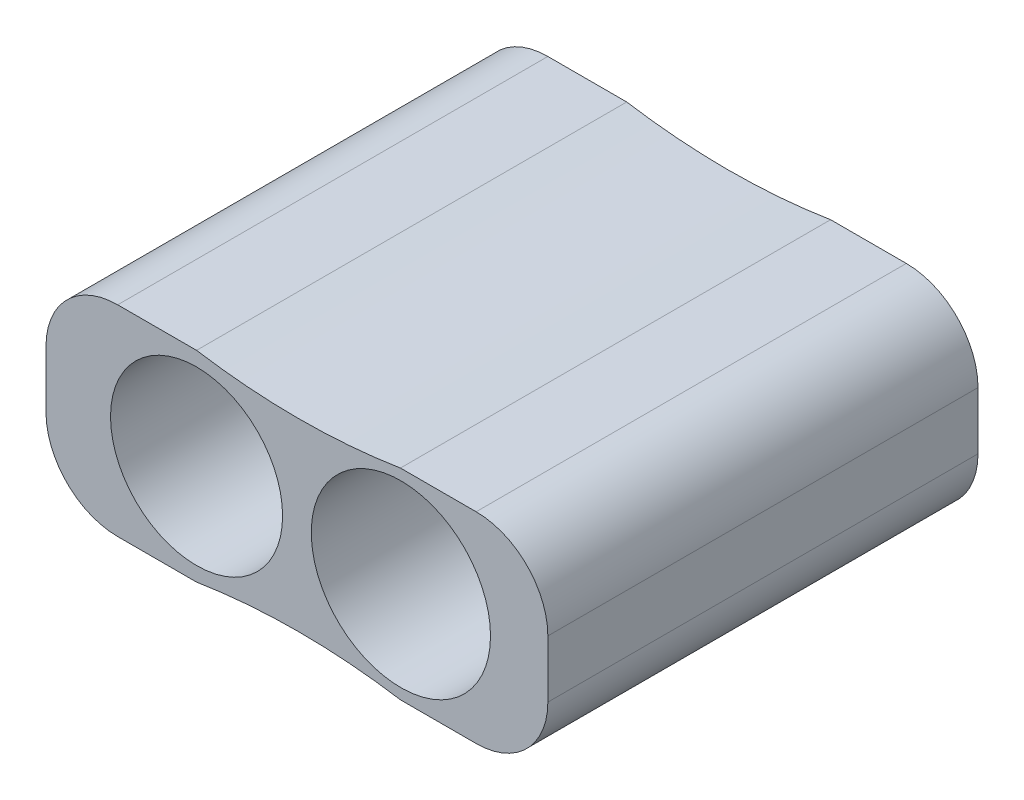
from build123d import *

# Parameters (mm, degrees)
CROQUIS1_W              = 35
CROQUIS1_H              = 14
CROQUIS1_R              = 6
CROQUIS1_R_2            = 6.25
SALIENTE_EXTRUIR1_DEPTH = 15
CROQUIS2_W              = 35
CROQUIS2_H              = 14
CROQUIS2_R              = 5
SALIENTE_EXTRUIR2_DEPTH = 15
CORTAR_EXTRUIR2_DEPTH   = 36.429507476
REDONDEO1_R             = 5


with BuildPart() as part:
    # Croquis1 → Saliente-Extruir1 (new body)
    with BuildSketch(Plane.XY):
        Rectangle(CROQUIS1_W, CROQUIS1_H)
        with Locations((-7, 0)):
            Circle(CROQUIS1_R, mode=Mode.SUBTRACT)
        with Locations((7.25, 0)):
            Circle(CROQUIS1_R_2, mode=Mode.SUBTRACT)
    extrude(amount=SALIENTE_EXTRUIR1_DEPTH)

    # Croquis2 → Saliente-Extruir2 (add)
    with BuildSketch(Plane(origin=(0, 0, 0), x_dir=(-1, 0, 0), z_dir=(0, 0, -1))):
        Rectangle(CROQUIS2_W, CROQUIS2_H)
        with Locations((-7.22, 0)):
            Circle(CROQUIS2_R, mode=Mode.SUBTRACT)
        with Locations((7, 0)):
            Circle(CROQUIS2_R, mode=Mode.SUBTRACT)
    extrude(amount=SALIENTE_EXTRUIR2_DEPTH)

    # Croquis3 → Cortar-Extruir2 (cut, through all)
    with BuildSketch(Plane(origin=(0, 0, -15), x_dir=(-1, 0, 0), z_dir=(0, 0, -1))):
        with BuildLine():
            Line((7, 7), (-7.22, 7))
            ThreePointArc((-7.22, 7), (-0.11, 6.434760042), (7, 7))
        make_face()
        with BuildLine():
            ThreePointArc((7, -7), (-0.11, -6.434760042), (-7.22, -7))
            Line((-7.22, -7), (7, -7))
        make_face()
    extrude(amount=-CORTAR_EXTRUIR2_DEPTH, mode=Mode.SUBTRACT)

    # Redondeo1
    redondeo1_edges = [part.edges().sort_by_distance(p)[0] for p in [
        (17.5, -7, 0),
        (-17.5, -7, 0),
        (-17.5, 7, 0),
        (17.5, 7, 0),
    ]]
    fillet(redondeo1_edges, radius=REDONDEO1_R)


solid = part.part
